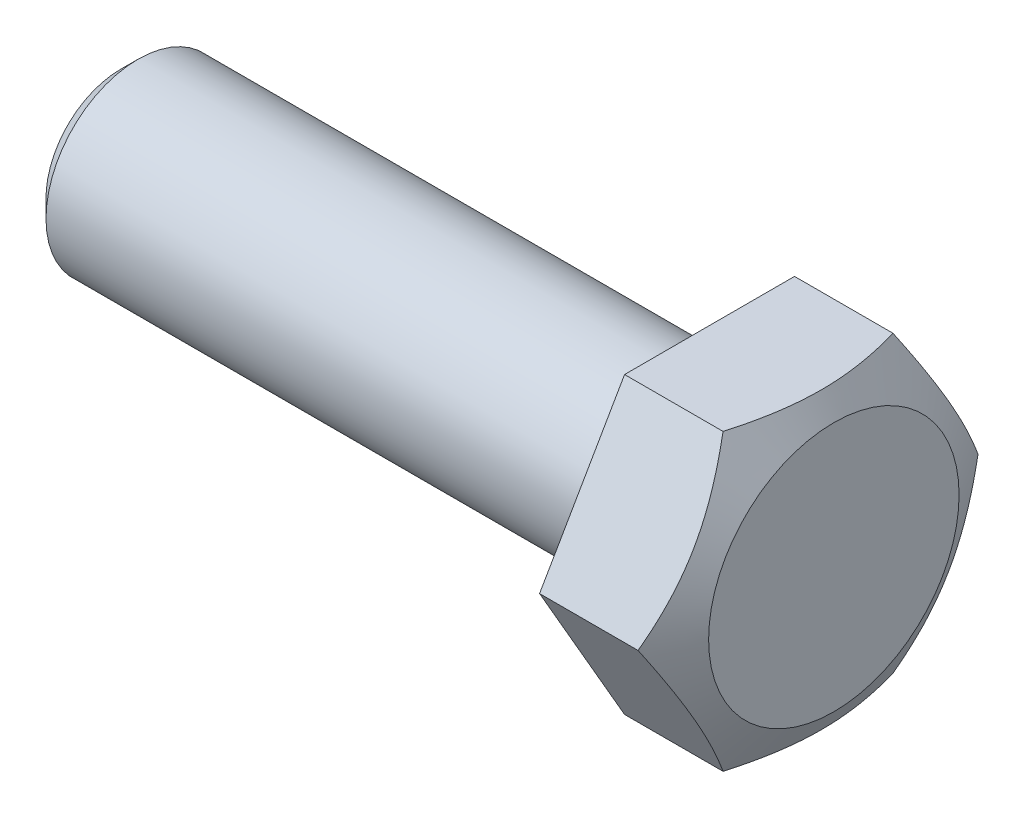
ISO-10303-21;
HEADER;
FILE_DESCRIPTION(('STEP AP214'),'2;1');
FILE_NAME('part.step','',(''),(''),'','','');
FILE_SCHEMA(('AUTOMOTIVE_DESIGN { 1 0 10303 214 1 1 1 1 }'));
ENDSEC;
DATA;
#1=APPLICATION_CONTEXT('core data for automotive mechanical design processes');
#2=APPLICATION_PROTOCOL_DEFINITION('international standard','automotive_design',2000,#1);
#3=PRODUCT_CONTEXT('',#1,'mechanical');
#4=PRODUCT('Part','Part','',(#3));
#5=PRODUCT_RELATED_PRODUCT_CATEGORY('part','',(#4));
#6=PRODUCT_DEFINITION_FORMATION('','',#4);
#7=PRODUCT_DEFINITION_CONTEXT('part definition',#1,'design');
#8=PRODUCT_DEFINITION('design','',#6,#7);
#9=PRODUCT_DEFINITION_SHAPE('','',#8);
#10=(LENGTH_UNIT() NAMED_UNIT(*) SI_UNIT(.MILLI.,.METRE.));
#11=(NAMED_UNIT(*) PLANE_ANGLE_UNIT() SI_UNIT($,.RADIAN.));
#12=(NAMED_UNIT(*) SI_UNIT($,.STERADIAN.) SOLID_ANGLE_UNIT());
#13=UNCERTAINTY_MEASURE_WITH_UNIT(LENGTH_MEASURE(1.E-05),#10,'distance_accuracy_value','');
#14=(GEOMETRIC_REPRESENTATION_CONTEXT(3) GLOBAL_UNCERTAINTY_ASSIGNED_CONTEXT((#13)) GLOBAL_UNIT_ASSIGNED_CONTEXT((#10,
#11,#12)) REPRESENTATION_CONTEXT('',''));
#15=CARTESIAN_POINT('',(0.,0.,0.));
#16=DIRECTION('',(0.,0.,1.));
#17=DIRECTION('',(1.,0.,0.));
#18=AXIS2_PLACEMENT_3D('',#15,#16,#17);
#19=CARTESIAN_POINT('',(25.4,3.96874999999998,0.));
#20=DIRECTION('',(-1.,0.,0.));
#21=DIRECTION('',(0.,-1.,0.));
#22=AXIS2_PLACEMENT_3D('',#19,#20,#21);
#23=PLANE('',#22);
#24=CARTESIAN_POINT('',(25.4,0.,0.));
#25=DIRECTION('',(1.,0.,0.));
#26=DIRECTION('',(0.,1.,0.));
#27=AXIS2_PLACEMENT_3D('',#24,#25,#26);
#28=CIRCLE('',#27,3.96874999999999);
#29=CARTESIAN_POINT('',(25.4,3.96874999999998,0.));
#30=VERTEX_POINT('',#29);
#31=EDGE_CURVE('E509',#30,#30,#28,.T.);
#32=ORIENTED_EDGE('',*,*,#31,.T.);
#33=EDGE_LOOP('',(#32));
#34=FACE_BOUND('',#33,.T.);
#35=DIRECTION('',(0.,-0.866025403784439,0.5));
#36=VECTOR('',#35,1.);
#37=CARTESIAN_POINT('',(25.4,-0.196511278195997,-7.21444416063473));
#38=LINE('',#37,#36);
#39=CARTESIAN_POINT('',(25.4,0.,-7.32789999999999));
#40=VERTEX_POINT('',#39);
#41=CARTESIAN_POINT('',(25.4,-6.34614755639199,-3.66394999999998));
#42=VERTEX_POINT('',#41);
#43=EDGE_CURVE('E435',#40,#42,#38,.T.);
#44=ORIENTED_EDGE('',*,*,#43,.T.);
#45=DIRECTION('',(0.,0.,1.));
#46=VECTOR('',#45,1.);
#47=CARTESIAN_POINT('',(25.4,-6.34614755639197,0.));
#48=LINE('',#47,#46);
#49=CARTESIAN_POINT('',(25.4,-6.34614755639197,3.66394999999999));
#50=VERTEX_POINT('',#49);
#51=EDGE_CURVE('E12',#42,#50,#48,.T.);
#52=ORIENTED_EDGE('',*,*,#51,.T.);
#53=DIRECTION('',(0.,0.866025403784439,0.5));
#54=VECTOR('',#53,1.);
#55=CARTESIAN_POINT('',(25.4,-0.196511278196,7.21444416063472));
#56=LINE('',#55,#54);
#57=CARTESIAN_POINT('',(25.4,0.,7.32789999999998));
#58=VERTEX_POINT('',#57);
#59=EDGE_CURVE('E393',#50,#58,#56,.T.);
#60=ORIENTED_EDGE('',*,*,#59,.T.);
#61=DIRECTION('',(0.,0.866025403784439,-0.5));
#62=VECTOR('',#61,1.);
#63=CARTESIAN_POINT('',(25.4,6.14963627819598,3.77740583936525));
#64=LINE('',#63,#62);
#65=CARTESIAN_POINT('',(25.4,6.34614755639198,3.66394999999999));
#66=VERTEX_POINT('',#65);
#67=EDGE_CURVE('E455',#58,#66,#64,.T.);
#68=ORIENTED_EDGE('',*,*,#67,.T.);
#69=DIRECTION('',(0.,0.,-1.));
#70=VECTOR('',#69,1.);
#71=CARTESIAN_POINT('',(25.4,6.34614755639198,0.));
#72=LINE('',#71,#70);
#73=CARTESIAN_POINT('',(25.4,6.34614755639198,-3.66394999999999));
#74=VERTEX_POINT('',#73);
#75=EDGE_CURVE('E453',#66,#74,#72,.T.);
#76=ORIENTED_EDGE('',*,*,#75,.T.);
#77=DIRECTION('',(0.,-0.866025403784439,-0.5));
#78=VECTOR('',#77,1.);
#79=CARTESIAN_POINT('',(25.4,6.14963627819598,-3.77740583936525));
#80=LINE('',#79,#78);
#81=EDGE_CURVE('E439',#74,#40,#80,.T.);
#82=ORIENTED_EDGE('',*,*,#81,.T.);
#83=EDGE_LOOP('',(#44,#52,#60,#68,#76,#82));
#84=FACE_BOUND('',#83,.T.);
#85=ADVANCED_FACE('F384',(#34,#84),#23,.T.);
#86=CARTESIAN_POINT('',(0.,0.,0.));
#87=DIRECTION('',(-1.,0.,0.));
#88=DIRECTION('',(0.,-1.,0.));
#89=AXIS2_PLACEMENT_3D('',#86,#87,#88);
#90=PLANE('',#89);
#91=CARTESIAN_POINT('',(0.,0.,0.));
#92=DIRECTION('',(1.,0.,0.));
#93=DIRECTION('',(0.,1.,0.));
#94=AXIS2_PLACEMENT_3D('',#91,#92,#93);
#95=CIRCLE('',#94,3.20674999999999);
#96=CARTESIAN_POINT('',(0.,3.20674999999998,0.));
#97=VERTEX_POINT('',#96);
#98=EDGE_CURVE('E521',#97,#97,#95,.T.);
#99=ORIENTED_EDGE('',*,*,#98,.F.);
#100=EDGE_LOOP('',(#99));
#101=FACE_BOUND('',#100,.T.);
#102=ADVANCED_FACE('F553',(#101),#90,.T.);
#103=CARTESIAN_POINT('',(0.761999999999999,0.,0.));
#104=DIRECTION('',(1.,0.,0.));
#105=DIRECTION('',(0.,1.,0.));
#106=AXIS2_PLACEMENT_3D('',#103,#104,#105);
#107=CONICAL_SURFACE('',#106,3.96874999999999,0.785398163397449);
#108=ORIENTED_EDGE('',*,*,#98,.T.);
#109=EDGE_LOOP('',(#108));
#110=FACE_BOUND('',#109,.T.);
#111=CARTESIAN_POINT('',(0.761999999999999,0.,0.));
#112=DIRECTION('',(1.,0.,0.));
#113=DIRECTION('',(0.,1.,0.));
#114=AXIS2_PLACEMENT_3D('',#111,#112,#113);
#115=CIRCLE('',#114,3.96874999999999);
#116=CARTESIAN_POINT('',(0.761999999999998,3.96874999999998,0.));
#117=VERTEX_POINT('',#116);
#118=EDGE_CURVE('E518',#117,#117,#115,.T.);
#119=ORIENTED_EDGE('',*,*,#118,.F.);
#120=EDGE_LOOP('',(#119));
#121=FACE_BOUND('',#120,.T.);
#122=ADVANCED_FACE('F559',(#110,#121),#107,.T.);
#123=CARTESIAN_POINT('',(64.0534023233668,0.,0.));
#124=DIRECTION('',(1.,0.,0.));
#125=DIRECTION('',(0.,1.,0.));
#126=AXIS2_PLACEMENT_3D('',#123,#124,#125);
#127=CYLINDRICAL_SURFACE('',#126,3.96874999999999);
#128=ORIENTED_EDGE('',*,*,#118,.T.);
#129=EDGE_LOOP('',(#128));
#130=FACE_BOUND('',#129,.T.);
#131=ORIENTED_EDGE('',*,*,#31,.F.);
#132=EDGE_LOOP('',(#131));
#133=FACE_BOUND('',#132,.T.);
#134=ADVANCED_FACE('F501',(#130,#133),#127,.T.);
#135=CARTESIAN_POINT('',(23.9522,-6.34614755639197,3.66394999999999));
#136=DIRECTION('',(0.,-1.,0.));
#137=DIRECTION('',(0.,0.,-1.));
#138=AXIS2_PLACEMENT_3D('',#135,#136,#137);
#139=PLANE('',#138);
#140=DIRECTION('',(1.,0.,0.));
#141=VECTOR('',#140,1.);
#142=CARTESIAN_POINT('',(23.9522,-6.34614755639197,3.66394999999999));
#143=LINE('',#142,#141);
#144=CARTESIAN_POINT('',(29.64586043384,-6.34614755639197,3.66394999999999));
#145=VERTEX_POINT('',#144);
#146=EDGE_CURVE('E465',#50,#145,#143,.T.);
#147=ORIENTED_EDGE('',*,*,#146,.F.);
#148=ORIENTED_EDGE('',*,*,#51,.F.);
#149=DIRECTION('',(1.,0.,0.));
#150=VECTOR('',#149,1.);
#151=CARTESIAN_POINT('',(23.9522,-6.34614755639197,-3.66395));
#152=LINE('',#151,#150);
#153=CARTESIAN_POINT('',(29.64586043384,-6.34614755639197,-3.66395));
#154=VERTEX_POINT('',#153);
#155=EDGE_CURVE('E405',#42,#154,#152,.T.);
#156=ORIENTED_EDGE('',*,*,#155,.T.);
#157=CARTESIAN_POINT('',(27.2123889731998,-6.34614755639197,-9.6417091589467));
#158=CARTESIAN_POINT('',(27.345255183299,-6.34614755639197,-9.36612343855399));
#159=CARTESIAN_POINT('',(27.4767880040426,-6.34614755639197,-9.0898830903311));
#160=CARTESIAN_POINT('',(27.7364325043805,-6.34614755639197,-8.53574412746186));
#161=CARTESIAN_POINT('',(27.8645436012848,-6.34614755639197,-8.25784524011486));
#162=CARTESIAN_POINT('',(28.1172782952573,-6.34614755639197,-7.69850992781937));
#163=CARTESIAN_POINT('',(28.2418772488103,-6.34614755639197,-7.4170623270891));
#164=CARTESIAN_POINT('',(28.4857003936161,-6.34614755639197,-6.85185704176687));
#165=CARTESIAN_POINT('',(28.6049248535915,-6.34614755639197,-6.56809947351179));
#166=CARTESIAN_POINT('',(28.8399471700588,-6.34614755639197,-5.98951609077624));
#167=CARTESIAN_POINT('',(28.9555445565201,-6.34614755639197,-5.69460837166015));
#168=CARTESIAN_POINT('',(29.1774957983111,-6.34614755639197,-5.1012704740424));
#169=CARTESIAN_POINT('',(29.2838485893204,-6.34614755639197,-4.802839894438));
#170=CARTESIAN_POINT('',(29.4843707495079,-6.34614755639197,-4.20260423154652));
#171=CARTESIAN_POINT('',(29.5785666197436,-6.34614755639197,-3.90080810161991));
#172=CARTESIAN_POINT('',(29.7516234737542,-6.34614755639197,-3.29290491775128));
#173=CARTESIAN_POINT('',(29.8304895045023,-6.34614755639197,-2.9867993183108));
#174=CARTESIAN_POINT('',(29.9685648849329,-6.34614755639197,-2.37168716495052));
#175=CARTESIAN_POINT('',(30.0278714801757,-6.34614755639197,-2.06270306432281));
#176=CARTESIAN_POINT('',(30.0994938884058,-6.34614755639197,-1.59658024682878));
#177=CARTESIAN_POINT('',(30.1204794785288,-6.34614755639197,-1.44075165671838));
#178=CARTESIAN_POINT('',(30.1562560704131,-6.34614755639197,-1.12839062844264));
#179=CARTESIAN_POINT('',(30.1710476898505,-6.34614755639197,-0.971858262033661));
#180=CARTESIAN_POINT('',(30.1939661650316,-6.34614755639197,-0.660253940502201));
#181=CARTESIAN_POINT('',(30.2021732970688,-6.34614755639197,-0.50518790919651));
#182=CARTESIAN_POINT('',(30.2120403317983,-6.34614755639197,-0.194848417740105));
#183=CARTESIAN_POINT('',(30.2137003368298,-6.34614755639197,-0.0395749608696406));
#184=CARTESIAN_POINT('',(30.210433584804,-6.34614755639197,0.270905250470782));
#185=CARTESIAN_POINT('',(30.2055067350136,-6.34614755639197,0.426112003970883));
#186=CARTESIAN_POINT('',(30.1891824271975,-6.34614755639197,0.736187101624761));
#187=CARTESIAN_POINT('',(30.1777846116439,-6.34614755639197,0.891055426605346));
#188=CARTESIAN_POINT('',(30.1422587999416,-6.34614755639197,1.26950249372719));
#189=CARTESIAN_POINT('',(30.1147147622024,-6.34614755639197,1.49276666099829));
#190=CARTESIAN_POINT('',(30.0477295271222,-6.34614755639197,1.93749305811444));
#191=CARTESIAN_POINT('',(30.0082865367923,-6.34614755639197,2.15895501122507));
#192=CARTESIAN_POINT('',(29.8742134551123,-6.34614755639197,2.82046479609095));
#193=CARTESIAN_POINT('',(29.7638683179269,-6.34614755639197,3.25736164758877));
#194=CARTESIAN_POINT('',(29.5743478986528,-6.34614755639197,3.91044954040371));
#195=CARTESIAN_POINT('',(29.5063255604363,-6.34614755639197,4.13006984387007));
#196=CARTESIAN_POINT('',(29.3636746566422,-6.34614755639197,4.56717541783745));
#197=CARTESIAN_POINT('',(29.2890460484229,-6.34614755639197,4.78466067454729));
#198=CARTESIAN_POINT('',(29.1343414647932,-6.34614755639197,5.21757405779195));
#199=CARTESIAN_POINT('',(29.0542675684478,-6.34614755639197,5.43300293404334));
#200=CARTESIAN_POINT('',(28.8895685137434,-6.34614755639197,5.86210682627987));
#201=CARTESIAN_POINT('',(28.8049433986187,-6.34614755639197,6.07578185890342));
#202=CARTESIAN_POINT('',(28.6069956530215,-6.34614755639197,6.56287924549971));
#203=CARTESIAN_POINT('',(28.4924248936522,-6.34614755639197,6.83579331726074));
#204=CARTESIAN_POINT('',(28.2582791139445,-6.34614755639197,7.37947178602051));
#205=CARTESIAN_POINT('',(28.138703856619,-6.34614755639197,7.65023608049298));
#206=CARTESIAN_POINT('',(27.895513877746,-6.34614755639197,8.18999317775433));
#207=CARTESIAN_POINT('',(27.7718985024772,-6.34614755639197,8.45898568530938));
#208=CARTESIAN_POINT('',(27.5213963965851,-6.34614755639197,8.9954452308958));
#209=CARTESIAN_POINT('',(27.3945096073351,-6.34614755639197,9.26291224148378));
#210=CARTESIAN_POINT('',(27.009640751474,-6.34614755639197,10.0638439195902));
#211=CARTESIAN_POINT('',(26.7476574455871,-6.34614755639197,10.5953849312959));
#212=CARTESIAN_POINT('',(26.2163568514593,-6.34614755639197,11.6547882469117));
#213=CARTESIAN_POINT('',(25.9470393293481,-6.34614755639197,12.1826504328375));
#214=CARTESIAN_POINT('',(25.5497251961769,-6.34614755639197,12.951828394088));
#215=CARTESIAN_POINT('',(25.4238076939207,-6.34614755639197,13.1942211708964));
#216=CARTESIAN_POINT('',(25.170995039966,-6.34614755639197,13.6784913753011));
#217=CARTESIAN_POINT('',(25.0440999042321,-6.34614755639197,13.9203688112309));
#218=CARTESIAN_POINT('',(24.6621323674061,-6.34614755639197,14.6453471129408));
#219=CARTESIAN_POINT('',(24.4057865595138,-6.34614755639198,15.1277771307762));
#220=CARTESIAN_POINT('',(23.8910415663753,-6.34614755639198,16.0902114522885));
#221=CARTESIAN_POINT('',(23.6326479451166,-6.34614755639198,16.5702187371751));
#222=CARTESIAN_POINT('',(23.1138009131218,-6.34614755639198,17.5290898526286));
#223=CARTESIAN_POINT('',(22.8533476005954,-6.34614755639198,18.0079537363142));
#224=CARTESIAN_POINT('',(22.5921188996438,-6.34614755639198,18.4863916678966));
#225=B_SPLINE_CURVE_WITH_KNOTS('',3,(#157,#158,#159,#160,#161,#162,#163,#164,#165,#166,#167,
#168,#169,#170,#171,#172,#173,#174,#175,#176,#177,#178,#179,#180,#181,#182,#183,#184,#185,#186,
#187,#188,#189,#190,#191,#192,#193,#194,#195,#196,#197,#198,#199,#200,#201,#202,#203,#204,#205,
#206,#207,#208,#209,#210,#211,#212,#213,#214,#215,#216,#217,#218,#219,#220,#221,#222,#223,#224),
.UNSPECIFIED.,.F.,.F.,(4,2,2,2,2,2,2,2,2,2,2,2,2,2,2,2,2,2,2,2,2,2,2,2,2,2,2,2,2,2,2,2,2,4),(0.,
0.917840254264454,1.83583582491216,2.75917539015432,3.6824687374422,4.63261169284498,
5.58286389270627,6.53100831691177,7.47884005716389,8.42188571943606,8.89348782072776,
9.36504288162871,9.83075757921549,10.2964649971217,10.7621789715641,11.2279186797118,
11.9024038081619,12.5769906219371,13.9269898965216,14.6166783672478,15.3063712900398,
15.9958023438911,16.6852268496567,17.5731233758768,18.4610619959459,19.3491450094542,
20.237243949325,22.0149395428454,23.7926918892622,24.6121321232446,25.4315590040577,
27.0704696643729,28.7058752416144,30.341203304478),.UNSPECIFIED.);
#226=EDGE_CURVE('E472',#145,#154,#225,.F.);
#227=ORIENTED_EDGE('',*,*,#226,.F.);
#228=EDGE_LOOP('',(#147,#148,#156,#227));
#229=FACE_BOUND('',#228,.T.);
#230=ADVANCED_FACE('F470',(#229),#139,.T.);
#231=CARTESIAN_POINT('',(23.9522,0.,7.32789999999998));
#232=DIRECTION('',(0.,-0.5,0.866025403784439));
#233=DIRECTION('',(0.,-0.866025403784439,-0.5));
#234=AXIS2_PLACEMENT_3D('',#231,#232,#233);
#235=PLANE('',#234);
#236=DIRECTION('',(1.,0.,0.));
#237=VECTOR('',#236,1.);
#238=CARTESIAN_POINT('',(23.9522,0.,7.32789999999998));
#239=LINE('',#238,#237);
#240=CARTESIAN_POINT('',(29.64586043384,0.,7.32789999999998));
#241=VERTEX_POINT('',#240);
#242=EDGE_CURVE('E468',#58,#241,#239,.T.);
#243=ORIENTED_EDGE('',*,*,#242,.F.);
#244=ORIENTED_EDGE('',*,*,#59,.F.);
#245=ORIENTED_EDGE('',*,*,#146,.T.);
#246=CARTESIAN_POINT('',(29.6457937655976,0.000200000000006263,7.32801547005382));
#247=CARTESIAN_POINT('',(29.6922855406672,-0.139295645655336,7.24747762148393));
#248=CARTESIAN_POINT('',(29.7366673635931,-0.279311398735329,7.16663948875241));
#249=CARTESIAN_POINT('',(29.8206299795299,-0.560479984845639,7.00430672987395));
#250=CARTESIAN_POINT('',(29.8602087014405,-0.701633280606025,6.92281183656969));
#251=CARTESIAN_POINT('',(29.9709633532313,-1.12735321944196,6.67702231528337));
#252=CARTESIAN_POINT('',(30.0339594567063,-1.41360032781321,6.51175747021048));
#253=CARTESIAN_POINT('',(30.1078300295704,-1.84196392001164,6.26444163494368));
#254=CARTESIAN_POINT('',(30.1288736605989,-1.98280049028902,6.18312960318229));
#255=CARTESIAN_POINT('',(30.164160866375,-2.26511000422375,6.02013812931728));
#256=CARTESIAN_POINT('',(30.1784050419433,-2.40658289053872,5.9384587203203));
#257=CARTESIAN_POINT('',(30.1997303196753,-2.68977437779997,5.77495803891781));
#258=CARTESIAN_POINT('',(30.2068195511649,-2.83149251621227,5.69313703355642));
#259=CARTESIAN_POINT('',(30.2136905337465,-3.11505188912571,5.5294239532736));
#260=CARTESIAN_POINT('',(30.213472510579,-3.25689311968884,5.44753188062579));
#261=CARTESIAN_POINT('',(30.2028308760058,-3.64549358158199,5.22317329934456));
#262=CARTESIAN_POINT('',(30.1849656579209,-3.89212561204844,5.08078023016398));
#263=CARTESIAN_POINT('',(30.1283144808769,-4.38375156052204,4.79693985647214));
#264=CARTESIAN_POINT('',(30.0895091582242,-4.62874374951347,4.65549355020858));
#265=CARTESIAN_POINT('',(29.9925069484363,-5.12135912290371,4.37108193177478));
#266=CARTESIAN_POINT('',(29.9338990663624,-5.36892014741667,4.22815250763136));
#267=CARTESIAN_POINT('',(29.8008827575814,-5.86035032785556,3.94442516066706));
#268=CARTESIAN_POINT('',(29.7265055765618,-6.10422577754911,3.80362360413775));
#269=CARTESIAN_POINT('',(29.6457937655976,-6.34634755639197,3.66383452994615));
#270=B_SPLINE_CURVE_WITH_KNOTS('',3,(#246,#247,#248,#249,#250,#251,#252,#253,#254,#255,#256,
#257,#258,#259,#260,#261,#262,#263,#264,#265,#266,#267,#268,#269),.UNSPECIFIED.,.F.,.F.,(4,2,2,
2,2,2,2,2,2,2,2,4),(0.,0.502912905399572,1.00604190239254,2.01439056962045,2.50621556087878,
2.99799708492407,3.48921922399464,3.98042618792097,4.8355667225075,5.69149937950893,
6.56641567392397,7.4396143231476),.UNSPECIFIED.);
#271=EDGE_CURVE('E510',#241,#145,#270,.T.);
#272=ORIENTED_EDGE('',*,*,#271,.F.);
#273=EDGE_LOOP('',(#243,#244,#245,#272));
#274=FACE_BOUND('',#273,.T.);
#275=ADVANCED_FACE('F464',(#274),#235,.T.);
#276=CARTESIAN_POINT('',(23.9522,6.34614755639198,3.66394999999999));
#277=DIRECTION('',(0.,0.5,0.866025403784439));
#278=DIRECTION('',(0.,-0.866025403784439,0.5));
#279=AXIS2_PLACEMENT_3D('',#276,#277,#278);
#280=PLANE('',#279);
#281=DIRECTION('',(1.,0.,0.));
#282=VECTOR('',#281,1.);
#283=CARTESIAN_POINT('',(23.9522,6.34614755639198,3.66394999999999));
#284=LINE('',#283,#282);
#285=CARTESIAN_POINT('',(29.64586043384,6.34614755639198,3.66394999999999));
#286=VERTEX_POINT('',#285);
#287=EDGE_CURVE('E476',#66,#286,#284,.T.);
#288=ORIENTED_EDGE('',*,*,#287,.F.);
#289=ORIENTED_EDGE('',*,*,#67,.F.);
#290=ORIENTED_EDGE('',*,*,#242,.T.);
#291=CARTESIAN_POINT('',(29.6457937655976,6.34634755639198,3.66383452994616));
#292=CARTESIAN_POINT('',(29.6922855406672,6.20685191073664,3.74437237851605));
#293=CARTESIAN_POINT('',(29.736667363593,6.06683615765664,3.82521051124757));
#294=CARTESIAN_POINT('',(29.8206299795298,5.78566757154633,3.98754327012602));
#295=CARTESIAN_POINT('',(29.8602087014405,5.64451427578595,4.06903816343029));
#296=CARTESIAN_POINT('',(29.9709633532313,5.21879433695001,4.31482768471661));
#297=CARTESIAN_POINT('',(30.0339594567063,4.93254722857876,4.4800925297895));
#298=CARTESIAN_POINT('',(30.1078300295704,4.50418363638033,4.7274083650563));
#299=CARTESIAN_POINT('',(30.1288736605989,4.36334706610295,4.80872039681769));
#300=CARTESIAN_POINT('',(30.164160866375,4.08103755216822,4.9717118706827));
#301=CARTESIAN_POINT('',(30.1784050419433,3.93956466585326,5.05339127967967));
#302=CARTESIAN_POINT('',(30.1997303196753,3.656373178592,5.21689196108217));
#303=CARTESIAN_POINT('',(30.2068195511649,3.5146550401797,5.29871296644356));
#304=CARTESIAN_POINT('',(30.2136905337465,3.23109566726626,5.46242604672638));
#305=CARTESIAN_POINT('',(30.213472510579,3.08925443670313,5.54431811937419));
#306=CARTESIAN_POINT('',(30.2028308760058,2.70065397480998,5.76867670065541));
#307=CARTESIAN_POINT('',(30.1849656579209,2.45402194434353,5.911069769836));
#308=CARTESIAN_POINT('',(30.1283144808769,1.96239599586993,6.19491014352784));
#309=CARTESIAN_POINT('',(30.0895091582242,1.7174038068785,6.3363564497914));
#310=CARTESIAN_POINT('',(29.9925069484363,1.22478843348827,6.6207680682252));
#311=CARTESIAN_POINT('',(29.9338990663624,0.977227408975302,6.76369749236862));
#312=CARTESIAN_POINT('',(29.8008827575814,0.485797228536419,7.04742483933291));
#313=CARTESIAN_POINT('',(29.7265055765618,0.241921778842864,7.18822639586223));
#314=CARTESIAN_POINT('',(29.6457937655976,-0.000199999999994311,7.32801547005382));
#315=B_SPLINE_CURVE_WITH_KNOTS('',3,(#291,#292,#293,#294,#295,#296,#297,#298,#299,#300,#301,
#302,#303,#304,#305,#306,#307,#308,#309,#310,#311,#312,#313,#314),.UNSPECIFIED.,.F.,.F.,(4,2,2,
2,2,2,2,2,2,2,2,4),(0.,0.502912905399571,1.00604190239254,2.01439056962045,2.50621556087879,
2.99799708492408,3.48921922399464,3.98042618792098,4.8355667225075,5.69149937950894,
6.56641567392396,7.4396143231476),.UNSPECIFIED.);
#316=EDGE_CURVE('E531',#286,#241,#315,.T.);
#317=ORIENTED_EDGE('',*,*,#316,.F.);
#318=EDGE_LOOP('',(#288,#289,#290,#317));
#319=FACE_BOUND('',#318,.T.);
#320=ADVANCED_FACE('F540',(#319),#280,.T.);
#321=CARTESIAN_POINT('',(23.9522,6.34614755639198,-3.66394999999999));
#322=DIRECTION('',(0.,1.,0.));
#323=DIRECTION('',(0.,0.,1.));
#324=AXIS2_PLACEMENT_3D('',#321,#322,#323);
#325=PLANE('',#324);
#326=DIRECTION('',(1.,0.,0.));
#327=VECTOR('',#326,1.);
#328=CARTESIAN_POINT('',(23.9522,6.34614755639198,-3.66394999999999));
#329=LINE('',#328,#327);
#330=CARTESIAN_POINT('',(29.64586043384,6.34614755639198,-3.66394999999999));
#331=VERTEX_POINT('',#330);
#332=EDGE_CURVE('E449',#74,#331,#329,.T.);
#333=ORIENTED_EDGE('',*,*,#332,.F.);
#334=ORIENTED_EDGE('',*,*,#75,.F.);
#335=ORIENTED_EDGE('',*,*,#287,.T.);
#336=CARTESIAN_POINT('',(27.2123889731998,6.34614755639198,-9.64170915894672));
#337=CARTESIAN_POINT('',(27.345255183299,6.34614755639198,-9.366123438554));
#338=CARTESIAN_POINT('',(27.4767880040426,6.34614755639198,-9.08988309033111));
#339=CARTESIAN_POINT('',(27.7364325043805,6.34614755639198,-8.53574412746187));
#340=CARTESIAN_POINT('',(27.8645436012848,6.34614755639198,-8.25784524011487));
#341=CARTESIAN_POINT('',(28.1172782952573,6.34614755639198,-7.69850992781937));
#342=CARTESIAN_POINT('',(28.2418772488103,6.34614755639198,-7.41706232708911));
#343=CARTESIAN_POINT('',(28.4857003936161,6.34614755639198,-6.85185704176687));
#344=CARTESIAN_POINT('',(28.6049248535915,6.34614755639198,-6.56809947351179));
#345=CARTESIAN_POINT('',(28.8399471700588,6.34614755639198,-5.98951609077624));
#346=CARTESIAN_POINT('',(28.9555445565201,6.34614755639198,-5.69460837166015));
#347=CARTESIAN_POINT('',(29.1774957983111,6.34614755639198,-5.1012704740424));
#348=CARTESIAN_POINT('',(29.2838485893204,6.34614755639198,-4.802839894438));
#349=CARTESIAN_POINT('',(29.4843707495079,6.34614755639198,-4.20260423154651));
#350=CARTESIAN_POINT('',(29.5785666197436,6.34614755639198,-3.9008081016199));
#351=CARTESIAN_POINT('',(29.7516234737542,6.34614755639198,-3.29290491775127));
#352=CARTESIAN_POINT('',(29.8304895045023,6.34614755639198,-2.9867993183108));
#353=CARTESIAN_POINT('',(29.9685648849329,6.34614755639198,-2.37168716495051));
#354=CARTESIAN_POINT('',(30.0278714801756,6.34614755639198,-2.0627030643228));
#355=CARTESIAN_POINT('',(30.0994938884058,6.34614755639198,-1.59658024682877));
#356=CARTESIAN_POINT('',(30.1204794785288,6.34614755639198,-1.44075165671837));
#357=CARTESIAN_POINT('',(30.1562560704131,6.34614755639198,-1.12839062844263));
#358=CARTESIAN_POINT('',(30.1710476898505,6.34614755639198,-0.97185826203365));
#359=CARTESIAN_POINT('',(30.1939661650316,6.34614755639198,-0.660253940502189));
#360=CARTESIAN_POINT('',(30.2021732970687,6.34614755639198,-0.505187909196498));
#361=CARTESIAN_POINT('',(30.2120403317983,6.34614755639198,-0.194848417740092));
#362=CARTESIAN_POINT('',(30.2137003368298,6.34614755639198,-0.0395749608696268));
#363=CARTESIAN_POINT('',(30.210433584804,6.34614755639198,0.270905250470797));
#364=CARTESIAN_POINT('',(30.2055067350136,6.34614755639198,0.426112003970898));
#365=CARTESIAN_POINT('',(30.1891824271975,6.34614755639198,0.736187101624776));
#366=CARTESIAN_POINT('',(30.1777846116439,6.34614755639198,0.891055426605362));
#367=CARTESIAN_POINT('',(30.1422587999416,6.34614755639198,1.26950249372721));
#368=CARTESIAN_POINT('',(30.1147147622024,6.34614755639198,1.49276666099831));
#369=CARTESIAN_POINT('',(30.0477295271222,6.34614755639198,1.93749305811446));
#370=CARTESIAN_POINT('',(30.0082865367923,6.34614755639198,2.15895501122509));
#371=CARTESIAN_POINT('',(29.8742134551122,6.34614755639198,2.82046479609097));
#372=CARTESIAN_POINT('',(29.7638683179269,6.34614755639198,3.2573616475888));
#373=CARTESIAN_POINT('',(29.5743478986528,6.34614755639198,3.91044954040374));
#374=CARTESIAN_POINT('',(29.5063255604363,6.34614755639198,4.1300698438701));
#375=CARTESIAN_POINT('',(29.3636746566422,6.34614755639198,4.56717541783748));
#376=CARTESIAN_POINT('',(29.2890460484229,6.34614755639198,4.78466067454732));
#377=CARTESIAN_POINT('',(29.1343414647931,6.34614755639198,5.21757405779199));
#378=CARTESIAN_POINT('',(29.0542675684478,6.34614755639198,5.43300293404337));
#379=CARTESIAN_POINT('',(28.8895685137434,6.34614755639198,5.86210682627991));
#380=CARTESIAN_POINT('',(28.8049433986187,6.34614755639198,6.07578185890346));
#381=CARTESIAN_POINT('',(28.6069956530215,6.34614755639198,6.56287924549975));
#382=CARTESIAN_POINT('',(28.4924248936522,6.34614755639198,6.83579331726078));
#383=CARTESIAN_POINT('',(28.2582791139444,6.34614755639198,7.37947178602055));
#384=CARTESIAN_POINT('',(28.1387038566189,6.34614755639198,7.65023608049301));
#385=CARTESIAN_POINT('',(27.895513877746,6.34614755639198,8.18999317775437));
#386=CARTESIAN_POINT('',(27.7718985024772,6.34614755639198,8.45898568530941));
#387=CARTESIAN_POINT('',(27.5213963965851,6.34614755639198,8.99544523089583));
#388=CARTESIAN_POINT('',(27.394509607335,6.34614755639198,9.26291224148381));
#389=CARTESIAN_POINT('',(27.0096407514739,6.34614755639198,10.0638439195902));
#390=CARTESIAN_POINT('',(26.7476574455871,6.34614755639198,10.5953849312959));
#391=CARTESIAN_POINT('',(26.2163568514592,6.34614755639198,11.6547882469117));
#392=CARTESIAN_POINT('',(25.9470393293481,6.34614755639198,12.1826504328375));
#393=CARTESIAN_POINT('',(25.5497251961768,6.34614755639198,12.9518283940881));
#394=CARTESIAN_POINT('',(25.4238076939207,6.34614755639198,13.1942211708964));
#395=CARTESIAN_POINT('',(25.1709950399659,6.34614755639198,13.6784913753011));
#396=CARTESIAN_POINT('',(25.0440999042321,6.34614755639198,13.920368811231));
#397=CARTESIAN_POINT('',(24.662132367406,6.34614755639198,14.6453471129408));
#398=CARTESIAN_POINT('',(24.4057865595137,6.34614755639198,15.1277771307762));
#399=CARTESIAN_POINT('',(23.8910415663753,6.34614755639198,16.0902114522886));
#400=CARTESIAN_POINT('',(23.6326479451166,6.34614755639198,16.5702187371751));
#401=CARTESIAN_POINT('',(23.1138009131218,6.34614755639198,17.5290898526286));
#402=CARTESIAN_POINT('',(22.8533476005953,6.34614755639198,18.0079537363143));
#403=CARTESIAN_POINT('',(22.5921188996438,6.34614755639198,18.4863916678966));
#404=B_SPLINE_CURVE_WITH_KNOTS('',3,(#336,#337,#338,#339,#340,#341,#342,#343,#344,#345,#346,
#347,#348,#349,#350,#351,#352,#353,#354,#355,#356,#357,#358,#359,#360,#361,#362,#363,#364,#365,
#366,#367,#368,#369,#370,#371,#372,#373,#374,#375,#376,#377,#378,#379,#380,#381,#382,#383,#384,
#385,#386,#387,#388,#389,#390,#391,#392,#393,#394,#395,#396,#397,#398,#399,#400,#401,#402,#403),
.UNSPECIFIED.,.F.,.F.,(4,2,2,2,2,2,2,2,2,2,2,2,2,2,2,2,2,2,2,2,2,2,2,2,2,2,2,2,2,2,2,2,2,4),(0.,
0.917840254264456,1.83583582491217,2.75917539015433,3.68246873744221,4.632611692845,
5.58286389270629,6.53100831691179,7.47884005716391,8.42188571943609,8.89348782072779,
9.36504288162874,9.83075757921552,10.2964649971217,10.7621789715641,11.2279186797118,
11.9024038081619,12.5769906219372,13.9269898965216,14.6166783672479,15.3063712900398,
15.9958023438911,16.6852268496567,17.5731233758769,18.461061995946,19.3491450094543,
20.237243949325,22.0149395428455,23.7926918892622,24.6121321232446,25.4315590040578,
27.0704696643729,28.7058752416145,30.3412033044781),.UNSPECIFIED.);
#405=EDGE_CURVE('E532',#331,#286,#404,.T.);
#406=ORIENTED_EDGE('',*,*,#405,.F.);
#407=EDGE_LOOP('',(#333,#334,#335,#406));
#408=FACE_BOUND('',#407,.T.);
#409=ADVANCED_FACE('F543',(#408),#325,.T.);
#410=CARTESIAN_POINT('',(23.9522,0.,-7.32789999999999));
#411=DIRECTION('',(0.,0.5,-0.866025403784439));
#412=DIRECTION('',(0.,0.866025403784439,0.5));
#413=AXIS2_PLACEMENT_3D('',#410,#411,#412);
#414=PLANE('',#413);
#415=DIRECTION('',(1.,0.,0.));
#416=VECTOR('',#415,1.);
#417=CARTESIAN_POINT('',(23.9522,0.,-7.32789999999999));
#418=LINE('',#417,#416);
#419=CARTESIAN_POINT('',(29.64586043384,0.,-7.32789999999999));
#420=VERTEX_POINT('',#419);
#421=EDGE_CURVE('E400',#40,#420,#418,.T.);
#422=ORIENTED_EDGE('',*,*,#421,.F.);
#423=ORIENTED_EDGE('',*,*,#81,.F.);
#424=ORIENTED_EDGE('',*,*,#332,.T.);
#425=CARTESIAN_POINT('',(29.6457937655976,-0.000199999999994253,-7.32801547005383));
#426=CARTESIAN_POINT('',(29.6922855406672,0.139295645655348,-7.24747762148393));
#427=CARTESIAN_POINT('',(29.7366673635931,0.279311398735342,-7.16663948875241));
#428=CARTESIAN_POINT('',(29.8206299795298,0.560479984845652,-7.00430672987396));
#429=CARTESIAN_POINT('',(29.8602087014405,0.701633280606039,-6.92281183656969));
#430=CARTESIAN_POINT('',(29.9709633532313,1.12735321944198,-6.67702231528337));
#431=CARTESIAN_POINT('',(30.0339594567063,1.41360032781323,-6.51175747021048));
#432=CARTESIAN_POINT('',(30.1078300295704,1.84196392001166,-6.26444163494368));
#433=CARTESIAN_POINT('',(30.1288736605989,1.98280049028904,-6.18312960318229));
#434=CARTESIAN_POINT('',(30.164160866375,2.26511000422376,-6.02013812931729));
#435=CARTESIAN_POINT('',(30.1784050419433,2.40658289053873,-5.93845872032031));
#436=CARTESIAN_POINT('',(30.1997303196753,2.68977437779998,-5.77495803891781));
#437=CARTESIAN_POINT('',(30.2068195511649,2.83149251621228,-5.69313703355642));
#438=CARTESIAN_POINT('',(30.2136905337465,3.11505188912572,-5.5294239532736));
#439=CARTESIAN_POINT('',(30.213472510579,3.25689311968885,-5.44753188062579));
#440=CARTESIAN_POINT('',(30.2028308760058,3.645493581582,-5.22317329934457));
#441=CARTESIAN_POINT('',(30.1849656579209,3.89212561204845,-5.08078023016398));
#442=CARTESIAN_POINT('',(30.1283144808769,4.38375156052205,-4.79693985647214));
#443=CARTESIAN_POINT('',(30.0895091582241,4.62874374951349,-4.65549355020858));
#444=CARTESIAN_POINT('',(29.9925069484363,5.12135912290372,-4.37108193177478));
#445=CARTESIAN_POINT('',(29.9338990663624,5.36892014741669,-4.22815250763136));
#446=CARTESIAN_POINT('',(29.8008827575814,5.86035032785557,-3.94442516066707));
#447=CARTESIAN_POINT('',(29.7265055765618,6.10422577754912,-3.80362360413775));
#448=CARTESIAN_POINT('',(29.6457937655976,6.34634755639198,-3.66383452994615));
#449=B_SPLINE_CURVE_WITH_KNOTS('',3,(#425,#426,#427,#428,#429,#430,#431,#432,#433,#434,#435,
#436,#437,#438,#439,#440,#441,#442,#443,#444,#445,#446,#447,#448),.UNSPECIFIED.,.F.,.F.,(4,2,2,
2,2,2,2,2,2,2,2,4),(0.,0.502912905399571,1.00604190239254,2.01439056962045,2.50621556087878,
2.99799708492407,3.48921922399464,3.98042618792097,4.8355667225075,5.69149937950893,
6.56641567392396,7.4396143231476),.UNSPECIFIED.);
#450=EDGE_CURVE('E447',#420,#331,#449,.T.);
#451=ORIENTED_EDGE('',*,*,#450,.F.);
#452=EDGE_LOOP('',(#422,#423,#424,#451));
#453=FACE_BOUND('',#452,.T.);
#454=ADVANCED_FACE('F443',(#453),#414,.T.);
#455=CARTESIAN_POINT('',(23.9522,-6.34614755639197,-3.66395));
#456=DIRECTION('',(0.,-0.5,-0.866025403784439));
#457=DIRECTION('',(0.,0.866025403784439,-0.5));
#458=AXIS2_PLACEMENT_3D('',#455,#456,#457);
#459=PLANE('',#458);
#460=ORIENTED_EDGE('',*,*,#155,.F.);
#461=ORIENTED_EDGE('',*,*,#43,.F.);
#462=ORIENTED_EDGE('',*,*,#421,.T.);
#463=CARTESIAN_POINT('',(29.6457937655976,-6.34634755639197,-3.66383452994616));
#464=CARTESIAN_POINT('',(29.6922855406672,-6.20685191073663,-3.74437237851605));
#465=CARTESIAN_POINT('',(29.7366673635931,-6.06683615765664,-3.82521051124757));
#466=CARTESIAN_POINT('',(29.8206299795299,-5.78566757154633,-3.98754327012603));
#467=CARTESIAN_POINT('',(29.8602087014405,-5.64451427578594,-4.06903816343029));
#468=CARTESIAN_POINT('',(29.9709633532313,-5.21879433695,-4.31482768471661));
#469=CARTESIAN_POINT('',(30.0339594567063,-4.93254722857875,-4.4800925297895));
#470=CARTESIAN_POINT('',(30.1078300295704,-4.50418363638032,-4.7274083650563));
#471=CARTESIAN_POINT('',(30.1288736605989,-4.36334706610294,-4.80872039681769));
#472=CARTESIAN_POINT('',(30.164160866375,-4.08103755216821,-4.9717118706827));
#473=CARTESIAN_POINT('',(30.1784050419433,-3.93956466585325,-5.05339127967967));
#474=CARTESIAN_POINT('',(30.1997303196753,-3.656373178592,-5.21689196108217));
#475=CARTESIAN_POINT('',(30.2068195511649,-3.5146550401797,-5.29871296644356));
#476=CARTESIAN_POINT('',(30.2136905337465,-3.23109566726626,-5.46242604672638));
#477=CARTESIAN_POINT('',(30.213472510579,-3.08925443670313,-5.54431811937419));
#478=CARTESIAN_POINT('',(30.2028308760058,-2.70065397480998,-5.76867670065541));
#479=CARTESIAN_POINT('',(30.1849656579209,-2.45402194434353,-5.911069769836));
#480=CARTESIAN_POINT('',(30.1283144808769,-1.96239599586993,-6.19491014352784));
#481=CARTESIAN_POINT('',(30.0895091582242,-1.7174038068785,-6.3363564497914));
#482=CARTESIAN_POINT('',(29.9925069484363,-1.22478843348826,-6.6207680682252));
#483=CARTESIAN_POINT('',(29.9338990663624,-0.977227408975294,-6.76369749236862));
#484=CARTESIAN_POINT('',(29.8008827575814,-0.48579722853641,-7.04742483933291));
#485=CARTESIAN_POINT('',(29.7265055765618,-0.241921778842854,-7.18822639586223));
#486=CARTESIAN_POINT('',(29.6457937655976,0.000200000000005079,-7.32801547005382));
#487=B_SPLINE_CURVE_WITH_KNOTS('',3,(#463,#464,#465,#466,#467,#468,#469,#470,#471,#472,#473,
#474,#475,#476,#477,#478,#479,#480,#481,#482,#483,#484,#485,#486),.UNSPECIFIED.,.F.,.F.,(4,2,2,
2,2,2,2,2,2,2,2,4),(0.,0.50291290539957,1.00604190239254,2.01439056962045,2.50621556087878,
2.99799708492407,3.48921922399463,3.98042618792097,4.8355667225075,5.69149937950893,
6.56641567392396,7.4396143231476),.UNSPECIFIED.);
#488=EDGE_CURVE('E473',#154,#420,#487,.T.);
#489=ORIENTED_EDGE('',*,*,#488,.F.);
#490=EDGE_LOOP('',(#460,#461,#462,#489));
#491=FACE_BOUND('',#490,.T.);
#492=ADVANCED_FACE('F436',(#491),#459,.T.);
#493=CARTESIAN_POINT('',(30.7594,0.,0.));
#494=DIRECTION('',(1.,0.,0.));
#495=DIRECTION('',(0.,1.,0.));
#496=AXIS2_PLACEMENT_3D('',#493,#494,#495);
#497=PLANE('',#496);
#498=CARTESIAN_POINT('',(30.7594,0.,0.));
#499=DIRECTION('',(1.,0.,0.));
#500=DIRECTION('',(0.,1.,0.));
#501=AXIS2_PLACEMENT_3D('',#498,#499,#500);
#502=CIRCLE('',#501,5.39919289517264);
#503=CARTESIAN_POINT('',(30.7594,5.39919289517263,0.));
#504=VERTEX_POINT('',#503);
#505=EDGE_CURVE('E440',#504,#504,#502,.T.);
#506=ORIENTED_EDGE('',*,*,#505,.T.);
#507=EDGE_LOOP('',(#506));
#508=FACE_BOUND('',#507,.T.);
#509=ADVANCED_FACE('F495',(#508),#497,.T.);
#510=CARTESIAN_POINT('',(30.7594,0.,0.));
#511=DIRECTION('',(-1.,0.,0.));
#512=DIRECTION('',(0.,-1.,0.));
#513=AXIS2_PLACEMENT_3D('',#510,#511,#512);
#514=CONICAL_SURFACE('',#513,5.39919289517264,1.0471975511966);
#515=ORIENTED_EDGE('',*,*,#505,.F.);
#516=EDGE_LOOP('',(#515));
#517=FACE_BOUND('',#516,.T.);
#518=ORIENTED_EDGE('',*,*,#271,.T.);
#519=ORIENTED_EDGE('',*,*,#226,.T.);
#520=ORIENTED_EDGE('',*,*,#488,.T.);
#521=ORIENTED_EDGE('',*,*,#450,.T.);
#522=ORIENTED_EDGE('',*,*,#405,.T.);
#523=ORIENTED_EDGE('',*,*,#316,.T.);
#524=EDGE_LOOP('',(#518,#519,#520,#521,#522,#523));
#525=FACE_BOUND('',#524,.T.);
#526=ADVANCED_FACE('F386',(#517,#525),#514,.T.);
#527=CLOSED_SHELL('',(#85,#102,#122,#134,#230,#275,#320,#409,#454,#492,#509,#526));
#528=MANIFOLD_SOLID_BREP('B2',#527);
#529=ADVANCED_BREP_SHAPE_REPRESENTATION('',(#18,#528),#14);
#530=SHAPE_DEFINITION_REPRESENTATION(#9,#529);
ENDSEC;
END-ISO-10303-21;
